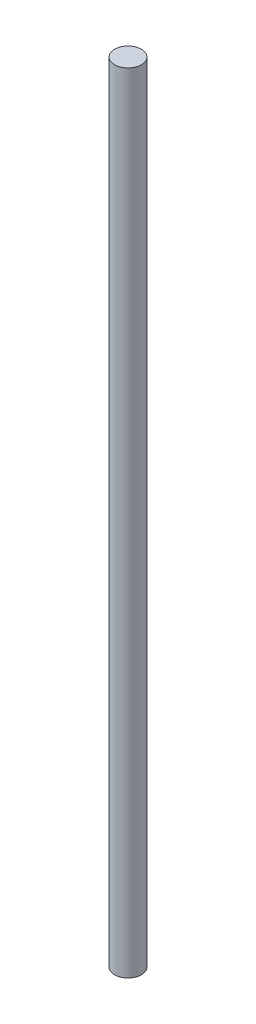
ISO-10303-21;
HEADER;
FILE_DESCRIPTION(('STEP AP214'),'2;1');
FILE_NAME('part.step','',(''),(''),'','','');
FILE_SCHEMA(('AUTOMOTIVE_DESIGN { 1 0 10303 214 1 1 1 1 }'));
ENDSEC;
DATA;
#1=APPLICATION_CONTEXT('core data for automotive mechanical design processes');
#2=APPLICATION_PROTOCOL_DEFINITION('international standard','automotive_design',2000,#1);
#3=PRODUCT_CONTEXT('',#1,'mechanical');
#4=PRODUCT('Part','Part','',(#3));
#5=PRODUCT_RELATED_PRODUCT_CATEGORY('part','',(#4));
#6=PRODUCT_DEFINITION_FORMATION('','',#4);
#7=PRODUCT_DEFINITION_CONTEXT('part definition',#1,'design');
#8=PRODUCT_DEFINITION('design','',#6,#7);
#9=PRODUCT_DEFINITION_SHAPE('','',#8);
#10=(LENGTH_UNIT() NAMED_UNIT(*) SI_UNIT(.MILLI.,.METRE.));
#11=(NAMED_UNIT(*) PLANE_ANGLE_UNIT() SI_UNIT($,.RADIAN.));
#12=(NAMED_UNIT(*) SI_UNIT($,.STERADIAN.) SOLID_ANGLE_UNIT());
#13=UNCERTAINTY_MEASURE_WITH_UNIT(LENGTH_MEASURE(1.E-05),#10,'distance_accuracy_value','');
#14=(GEOMETRIC_REPRESENTATION_CONTEXT(3) GLOBAL_UNCERTAINTY_ASSIGNED_CONTEXT((#13)) GLOBAL_UNIT_ASSIGNED_CONTEXT((#10,
#11,#12)) REPRESENTATION_CONTEXT('',''));
#15=CARTESIAN_POINT('',(0.,0.,0.));
#16=DIRECTION('',(0.,0.,1.));
#17=DIRECTION('',(1.,0.,0.));
#18=AXIS2_PLACEMENT_3D('',#15,#16,#17);
#19=CARTESIAN_POINT('',(0.,279.4,0.));
#20=DIRECTION('',(0.,-1.,0.));
#21=DIRECTION('',(0.,0.,-1.));
#22=AXIS2_PLACEMENT_3D('',#19,#20,#21);
#23=CYLINDRICAL_SURFACE('',#22,4.7625);
#24=CARTESIAN_POINT('',(0.,279.4,0.));
#25=DIRECTION('',(0.,1.,0.));
#26=DIRECTION('',(0.,0.,1.));
#27=AXIS2_PLACEMENT_3D('',#24,#25,#26);
#28=CIRCLE('',#27,4.7625);
#29=CARTESIAN_POINT('',(0.,279.4,4.7625));
#30=VERTEX_POINT('',#29);
#31=EDGE_CURVE('E10',#30,#30,#28,.T.);
#32=ORIENTED_EDGE('',*,*,#31,.F.);
#33=EDGE_LOOP('',(#32));
#34=FACE_BOUND('',#33,.T.);
#35=CARTESIAN_POINT('',(0.,0.,0.));
#36=DIRECTION('',(0.,1.,0.));
#37=DIRECTION('',(0.,0.,1.));
#38=AXIS2_PLACEMENT_3D('',#35,#36,#37);
#39=CIRCLE('',#38,4.7625);
#40=CARTESIAN_POINT('',(0.,0.,4.7625));
#41=VERTEX_POINT('',#40);
#42=EDGE_CURVE('E38',#41,#41,#39,.T.);
#43=ORIENTED_EDGE('',*,*,#42,.T.);
#44=EDGE_LOOP('',(#43));
#45=FACE_BOUND('',#44,.T.);
#46=ADVANCED_FACE('F32',(#34,#45),#23,.T.);
#47=CARTESIAN_POINT('',(0.,279.4,0.));
#48=DIRECTION('',(0.,1.,0.));
#49=DIRECTION('',(0.,0.,1.));
#50=AXIS2_PLACEMENT_3D('',#47,#48,#49);
#51=PLANE('',#50);
#52=ORIENTED_EDGE('',*,*,#31,.T.);
#53=EDGE_LOOP('',(#52));
#54=FACE_BOUND('',#53,.T.);
#55=ADVANCED_FACE('F47',(#54),#51,.T.);
#56=CARTESIAN_POINT('',(0.,0.,0.));
#57=DIRECTION('',(0.,1.,0.));
#58=DIRECTION('',(0.,0.,1.));
#59=AXIS2_PLACEMENT_3D('',#56,#57,#58);
#60=PLANE('',#59);
#61=ORIENTED_EDGE('',*,*,#42,.F.);
#62=EDGE_LOOP('',(#61));
#63=FACE_BOUND('',#62,.T.);
#64=ADVANCED_FACE('F45',(#63),#60,.F.);
#65=CLOSED_SHELL('',(#46,#55,#64));
#66=MANIFOLD_SOLID_BREP('B2',#65);
#67=ADVANCED_BREP_SHAPE_REPRESENTATION('',(#18,#66),#14);
#68=SHAPE_DEFINITION_REPRESENTATION(#9,#67);
ENDSEC;
END-ISO-10303-21;
